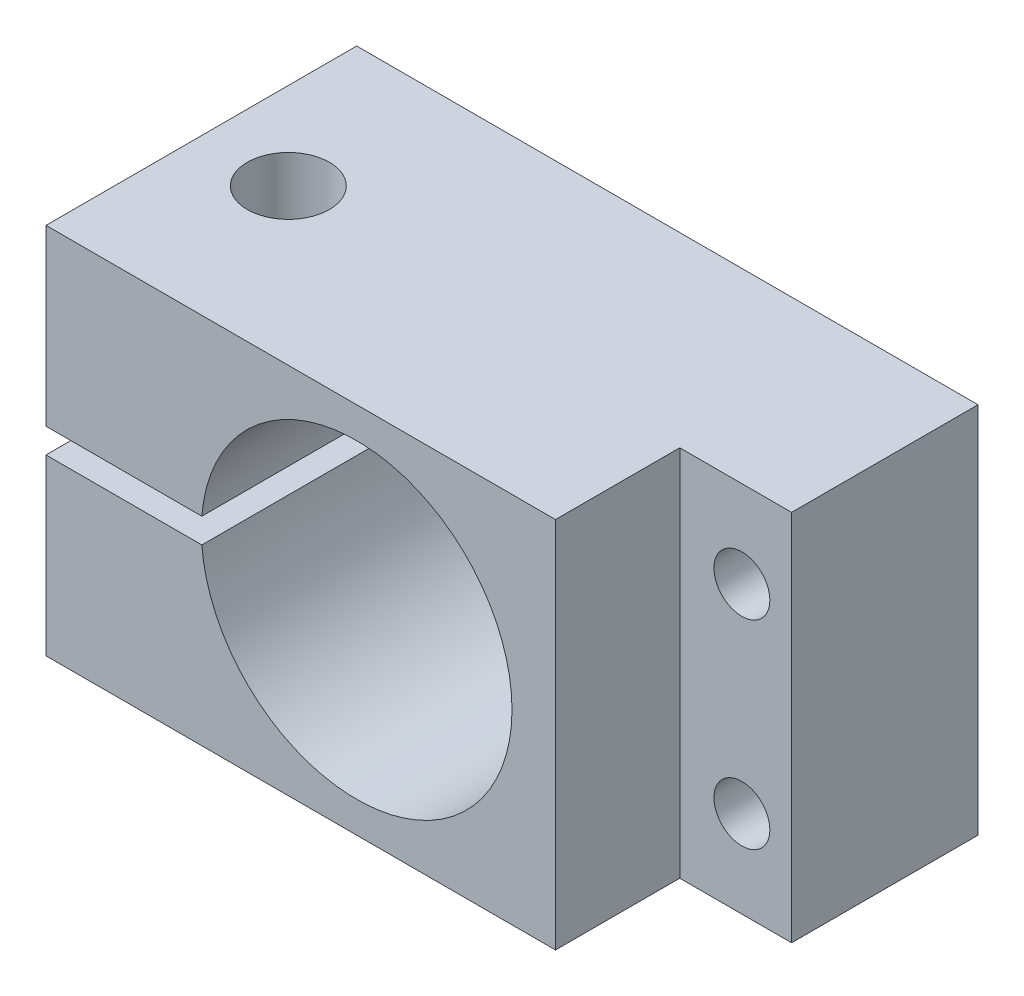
ISO-10303-21;
HEADER;
FILE_DESCRIPTION(('STEP AP214'),'2;1');
FILE_NAME('part.step','',(''),(''),'','','');
FILE_SCHEMA(('AUTOMOTIVE_DESIGN { 1 0 10303 214 1 1 1 1 }'));
ENDSEC;
DATA;
#1=APPLICATION_CONTEXT('core data for automotive mechanical design processes');
#2=APPLICATION_PROTOCOL_DEFINITION('international standard','automotive_design',2000,#1);
#3=PRODUCT_CONTEXT('',#1,'mechanical');
#4=PRODUCT('Part','Part','',(#3));
#5=PRODUCT_RELATED_PRODUCT_CATEGORY('part','',(#4));
#6=PRODUCT_DEFINITION_FORMATION('','',#4);
#7=PRODUCT_DEFINITION_CONTEXT('part definition',#1,'design');
#8=PRODUCT_DEFINITION('design','',#6,#7);
#9=PRODUCT_DEFINITION_SHAPE('','',#8);
#10=(LENGTH_UNIT() NAMED_UNIT(*) SI_UNIT(.MILLI.,.METRE.));
#11=(NAMED_UNIT(*) PLANE_ANGLE_UNIT() SI_UNIT($,.RADIAN.));
#12=(NAMED_UNIT(*) SI_UNIT($,.STERADIAN.) SOLID_ANGLE_UNIT());
#13=UNCERTAINTY_MEASURE_WITH_UNIT(LENGTH_MEASURE(1.E-05),#10,'distance_accuracy_value','');
#14=(GEOMETRIC_REPRESENTATION_CONTEXT(3) GLOBAL_UNCERTAINTY_ASSIGNED_CONTEXT((#13)) GLOBAL_UNIT_ASSIGNED_CONTEXT((#10,
#11,#12)) REPRESENTATION_CONTEXT('',''));
#15=CARTESIAN_POINT('',(0.,0.,0.));
#16=DIRECTION('',(0.,0.,1.));
#17=DIRECTION('',(1.,0.,0.));
#18=AXIS2_PLACEMENT_3D('',#15,#16,#17);
#19=CARTESIAN_POINT('',(25.,15.,12.5));
#20=DIRECTION('',(0.,-1.,0.));
#21=DIRECTION('',(0.,0.,-1.));
#22=AXIS2_PLACEMENT_3D('',#19,#20,#21);
#23=PLANE('',#22);
#24=DIRECTION('',(-1.,0.,0.));
#25=VECTOR('',#24,1.);
#26=CARTESIAN_POINT('',(25.,15.,2.5));
#27=LINE('',#26,#25);
#28=CARTESIAN_POINT('',(25.,15.,2.5));
#29=VERTEX_POINT('',#28);
#30=CARTESIAN_POINT('',(16.,15.,2.5));
#31=VERTEX_POINT('',#30);
#32=EDGE_CURVE('E112',#29,#31,#27,.T.);
#33=ORIENTED_EDGE('',*,*,#32,.F.);
#34=DIRECTION('',(0.,0.,-1.));
#35=VECTOR('',#34,1.);
#36=CARTESIAN_POINT('',(25.,15.,12.5));
#37=LINE('',#36,#35);
#38=CARTESIAN_POINT('',(25.,15.,-12.5));
#39=VERTEX_POINT('',#38);
#40=EDGE_CURVE('E174',#29,#39,#37,.T.);
#41=ORIENTED_EDGE('',*,*,#40,.T.);
#42=DIRECTION('',(-1.,0.,0.));
#43=VECTOR('',#42,1.);
#44=CARTESIAN_POINT('',(25.,15.,-12.5));
#45=LINE('',#44,#43);
#46=CARTESIAN_POINT('',(-25.,15.,-12.5));
#47=VERTEX_POINT('',#46);
#48=EDGE_CURVE('E153',#39,#47,#45,.T.);
#49=ORIENTED_EDGE('',*,*,#48,.T.);
#50=DIRECTION('',(0.,0.,-1.));
#51=VECTOR('',#50,1.);
#52=CARTESIAN_POINT('',(-25.,15.,12.5));
#53=LINE('',#52,#51);
#54=CARTESIAN_POINT('',(-25.,15.,12.5));
#55=VERTEX_POINT('',#54);
#56=EDGE_CURVE('E181',#55,#47,#53,.T.);
#57=ORIENTED_EDGE('',*,*,#56,.F.);
#58=DIRECTION('',(-1.,0.,0.));
#59=VECTOR('',#58,1.);
#60=CARTESIAN_POINT('',(25.,15.,12.5));
#61=LINE('',#60,#59);
#62=CARTESIAN_POINT('',(16.,15.,12.5));
#63=VERTEX_POINT('',#62);
#64=EDGE_CURVE('E131',#63,#55,#61,.T.);
#65=ORIENTED_EDGE('',*,*,#64,.F.);
#66=DIRECTION('',(0.,0.,1.));
#67=VECTOR('',#66,1.);
#68=CARTESIAN_POINT('',(16.,15.,12.5));
#69=LINE('',#68,#67);
#70=EDGE_CURVE('E123',#31,#63,#69,.T.);
#71=ORIENTED_EDGE('',*,*,#70,.F.);
#72=EDGE_LOOP('',(#33,#41,#49,#57,#65,#71));
#73=FACE_BOUND('',#72,.T.);
#74=CARTESIAN_POINT('',(-18.,15.,0.));
#75=DIRECTION('',(0.,1.,0.));
#76=DIRECTION('',(0.,0.,1.));
#77=AXIS2_PLACEMENT_3D('',#74,#75,#76);
#78=CIRCLE('',#77,3.3);
#79=CARTESIAN_POINT('',(-18.,15.,3.3));
#80=VERTEX_POINT('',#79);
#81=EDGE_CURVE('E187',#80,#80,#78,.T.);
#82=ORIENTED_EDGE('',*,*,#81,.F.);
#83=EDGE_LOOP('',(#82));
#84=FACE_BOUND('',#83,.T.);
#85=ADVANCED_FACE('F35',(#73,#84),#23,.F.);
#86=CARTESIAN_POINT('',(-25.,-15.,12.5));
#87=DIRECTION('',(0.,1.,0.));
#88=DIRECTION('',(0.,0.,1.));
#89=AXIS2_PLACEMENT_3D('',#86,#87,#88);
#90=PLANE('',#89);
#91=DIRECTION('',(1.,0.,0.));
#92=VECTOR('',#91,1.);
#93=CARTESIAN_POINT('',(-25.,-15.,2.5));
#94=LINE('',#93,#92);
#95=CARTESIAN_POINT('',(16.,-15.,2.5));
#96=VERTEX_POINT('',#95);
#97=CARTESIAN_POINT('',(25.,-15.,2.5));
#98=VERTEX_POINT('',#97);
#99=EDGE_CURVE('E51',#96,#98,#94,.T.);
#100=ORIENTED_EDGE('',*,*,#99,.F.);
#101=DIRECTION('',(0.,0.,-1.));
#102=VECTOR('',#101,1.);
#103=CARTESIAN_POINT('',(16.,-15.,12.5));
#104=LINE('',#103,#102);
#105=CARTESIAN_POINT('',(16.,-15.,12.5));
#106=VERTEX_POINT('',#105);
#107=EDGE_CURVE('E12',#106,#96,#104,.T.);
#108=ORIENTED_EDGE('',*,*,#107,.F.);
#109=DIRECTION('',(1.,0.,0.));
#110=VECTOR('',#109,1.);
#111=CARTESIAN_POINT('',(-25.,-15.,12.5));
#112=LINE('',#111,#110);
#113=CARTESIAN_POINT('',(-25.,-15.,12.5));
#114=VERTEX_POINT('',#113);
#115=EDGE_CURVE('E171',#114,#106,#112,.T.);
#116=ORIENTED_EDGE('',*,*,#115,.F.);
#117=DIRECTION('',(0.,0.,-1.));
#118=VECTOR('',#117,1.);
#119=CARTESIAN_POINT('',(-25.,-15.,12.5));
#120=LINE('',#119,#118);
#121=CARTESIAN_POINT('',(-25.,-15.,-12.5));
#122=VERTEX_POINT('',#121);
#123=EDGE_CURVE('E178',#114,#122,#120,.T.);
#124=ORIENTED_EDGE('',*,*,#123,.T.);
#125=DIRECTION('',(1.,0.,0.));
#126=VECTOR('',#125,1.);
#127=CARTESIAN_POINT('',(-25.,-15.,-12.5));
#128=LINE('',#127,#126);
#129=CARTESIAN_POINT('',(25.,-15.,-12.5));
#130=VERTEX_POINT('',#129);
#131=EDGE_CURVE('E160',#122,#130,#128,.T.);
#132=ORIENTED_EDGE('',*,*,#131,.T.);
#133=DIRECTION('',(0.,0.,-1.));
#134=VECTOR('',#133,1.);
#135=CARTESIAN_POINT('',(25.,-15.,12.5));
#136=LINE('',#135,#134);
#137=EDGE_CURVE('E176',#98,#130,#136,.T.);
#138=ORIENTED_EDGE('',*,*,#137,.F.);
#139=EDGE_LOOP('',(#100,#108,#116,#124,#132,#138));
#140=FACE_BOUND('',#139,.T.);
#141=CARTESIAN_POINT('',(-18.,-15.,0.));
#142=DIRECTION('',(0.,1.,0.));
#143=DIRECTION('',(0.,0.,1.));
#144=AXIS2_PLACEMENT_3D('',#141,#142,#143);
#145=CIRCLE('',#144,3.);
#146=CARTESIAN_POINT('',(-18.,-15.,3.));
#147=VERTEX_POINT('',#146);
#148=EDGE_CURVE('E199',#147,#147,#145,.T.);
#149=ORIENTED_EDGE('',*,*,#148,.T.);
#150=EDGE_LOOP('',(#149));
#151=FACE_BOUND('',#150,.T.);
#152=ADVANCED_FACE('F234',(#140,#151),#90,.F.);
#153=CARTESIAN_POINT('',(-12.459935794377,1.,12.5));
#154=DIRECTION('',(0.,-1.,0.));
#155=DIRECTION('',(0.,0.,-1.));
#156=AXIS2_PLACEMENT_3D('',#153,#154,#155);
#157=PLANE('',#156);
#158=DIRECTION('',(0.,0.,-1.));
#159=VECTOR('',#158,1.);
#160=CARTESIAN_POINT('',(-25.,1.,12.5));
#161=LINE('',#160,#159);
#162=CARTESIAN_POINT('',(-25.,1.,12.5));
#163=VERTEX_POINT('',#162);
#164=CARTESIAN_POINT('',(-25.,1.,-12.5));
#165=VERTEX_POINT('',#164);
#166=EDGE_CURVE('E151',#163,#165,#161,.T.);
#167=ORIENTED_EDGE('',*,*,#166,.T.);
#168=DIRECTION('',(-1.,0.,0.));
#169=VECTOR('',#168,1.);
#170=CARTESIAN_POINT('',(-12.459935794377,1.,-12.5));
#171=LINE('',#170,#169);
#172=CARTESIAN_POINT('',(-12.459935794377,0.999999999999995,-12.5));
#173=VERTEX_POINT('',#172);
#174=EDGE_CURVE('E59',#173,#165,#171,.T.);
#175=ORIENTED_EDGE('',*,*,#174,.F.);
#176=DIRECTION('',(0.,0.,-1.));
#177=VECTOR('',#176,1.);
#178=CARTESIAN_POINT('',(-12.459935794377,0.999999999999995,12.5));
#179=LINE('',#178,#177);
#180=CARTESIAN_POINT('',(-12.459935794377,0.999999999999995,12.5));
#181=VERTEX_POINT('',#180);
#182=EDGE_CURVE('E145',#181,#173,#179,.T.);
#183=ORIENTED_EDGE('',*,*,#182,.F.);
#184=DIRECTION('',(-1.,0.,0.));
#185=VECTOR('',#184,1.);
#186=CARTESIAN_POINT('',(-12.459935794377,1.,12.5));
#187=LINE('',#186,#185);
#188=EDGE_CURVE('E139',#181,#163,#187,.T.);
#189=ORIENTED_EDGE('',*,*,#188,.T.);
#190=EDGE_LOOP('',(#167,#175,#183,#189));
#191=FACE_BOUND('',#190,.T.);
#192=CARTESIAN_POINT('',(-18.,1.,0.));
#193=DIRECTION('',(0.,-1.,0.));
#194=DIRECTION('',(0.,0.,-1.));
#195=AXIS2_PLACEMENT_3D('',#192,#193,#194);
#196=CIRCLE('',#195,3.3);
#197=CARTESIAN_POINT('',(-18.,1.,-3.3));
#198=VERTEX_POINT('',#197);
#199=EDGE_CURVE('E38',#198,#198,#196,.F.);
#200=ORIENTED_EDGE('',*,*,#199,.T.);
#201=EDGE_LOOP('',(#200));
#202=FACE_BOUND('',#201,.T.);
#203=ADVANCED_FACE('F238',(#191,#202),#157,.T.);
#204=CARTESIAN_POINT('',(-26.,-1.,12.5));
#205=DIRECTION('',(0.,1.,0.));
#206=DIRECTION('',(0.,0.,1.));
#207=AXIS2_PLACEMENT_3D('',#204,#205,#206);
#208=PLANE('',#207);
#209=DIRECTION('',(0.,0.,1.));
#210=VECTOR('',#209,1.);
#211=CARTESIAN_POINT('',(-25.,-1.,12.5));
#212=LINE('',#211,#210);
#213=CARTESIAN_POINT('',(-25.,-1.,-12.5));
#214=VERTEX_POINT('',#213);
#215=CARTESIAN_POINT('',(-25.,-1.,12.5));
#216=VERTEX_POINT('',#215);
#217=EDGE_CURVE('E149',#214,#216,#212,.T.);
#218=ORIENTED_EDGE('',*,*,#217,.T.);
#219=DIRECTION('',(1.,0.,0.));
#220=VECTOR('',#219,1.);
#221=CARTESIAN_POINT('',(-26.,-1.,12.5));
#222=LINE('',#221,#220);
#223=CARTESIAN_POINT('',(-12.459935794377,-1.,12.5));
#224=VERTEX_POINT('',#223);
#225=EDGE_CURVE('E141',#216,#224,#222,.T.);
#226=ORIENTED_EDGE('',*,*,#225,.T.);
#227=DIRECTION('',(0.,0.,-1.));
#228=VECTOR('',#227,1.);
#229=CARTESIAN_POINT('',(-12.459935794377,-1.,12.5));
#230=LINE('',#229,#228);
#231=CARTESIAN_POINT('',(-12.459935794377,-1.,-12.5));
#232=VERTEX_POINT('',#231);
#233=EDGE_CURVE('E147',#224,#232,#230,.T.);
#234=ORIENTED_EDGE('',*,*,#233,.T.);
#235=DIRECTION('',(-1.,0.,0.));
#236=VECTOR('',#235,1.);
#237=CARTESIAN_POINT('',(-25.,-1.,-12.5));
#238=LINE('',#237,#236);
#239=EDGE_CURVE('E183',#232,#214,#238,.T.);
#240=ORIENTED_EDGE('',*,*,#239,.T.);
#241=EDGE_LOOP('',(#218,#226,#234,#240));
#242=FACE_BOUND('',#241,.T.);
#243=CARTESIAN_POINT('',(-18.,-1.,0.));
#244=DIRECTION('',(0.,1.,0.));
#245=DIRECTION('',(0.,0.,1.));
#246=AXIS2_PLACEMENT_3D('',#243,#244,#245);
#247=CIRCLE('',#246,2.4585);
#248=CARTESIAN_POINT('',(-18.,-1.,2.4585));
#249=VERTEX_POINT('',#248);
#250=EDGE_CURVE('E185',#249,#249,#247,.F.);
#251=ORIENTED_EDGE('',*,*,#250,.T.);
#252=EDGE_LOOP('',(#251));
#253=FACE_BOUND('',#252,.T.);
#254=ADVANCED_FACE('F244',(#242,#253),#208,.T.);
#255=CARTESIAN_POINT('',(-25.,15.,12.5));
#256=DIRECTION('',(0.,0.,1.));
#257=DIRECTION('',(1.,0.,0.));
#258=AXIS2_PLACEMENT_3D('',#255,#256,#257);
#259=PLANE('',#258);
#260=ORIENTED_EDGE('',*,*,#115,.T.);
#261=DIRECTION('',(0.,1.,0.));
#262=VECTOR('',#261,1.);
#263=CARTESIAN_POINT('',(16.,15.,12.5));
#264=LINE('',#263,#262);
#265=EDGE_CURVE('E119',#106,#63,#264,.T.);
#266=ORIENTED_EDGE('',*,*,#265,.T.);
#267=ORIENTED_EDGE('',*,*,#64,.T.);
#268=DIRECTION('',(0.,-1.,0.));
#269=VECTOR('',#268,1.);
#270=CARTESIAN_POINT('',(-25.,15.,12.5));
#271=LINE('',#270,#269);
#272=EDGE_CURVE('E168',#55,#163,#271,.T.);
#273=ORIENTED_EDGE('',*,*,#272,.T.);
#274=ORIENTED_EDGE('',*,*,#188,.F.);
#275=CARTESIAN_POINT('',(0.,0.,12.5));
#276=DIRECTION('',(0.,0.,1.));
#277=DIRECTION('',(1.,0.,0.));
#278=AXIS2_PLACEMENT_3D('',#275,#276,#277);
#279=CIRCLE('',#278,12.4999999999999);
#280=EDGE_CURVE('E143',#224,#181,#279,.T.);
#281=ORIENTED_EDGE('',*,*,#280,.F.);
#282=ORIENTED_EDGE('',*,*,#225,.F.);
#283=EDGE_CURVE('E167',#216,#114,#271,.T.);
#284=ORIENTED_EDGE('',*,*,#283,.T.);
#285=EDGE_LOOP('',(#260,#266,#267,#273,#274,#281,#282,#284));
#286=FACE_BOUND('',#285,.T.);
#287=ADVANCED_FACE('F259',(#286),#259,.T.);
#288=CARTESIAN_POINT('',(25.,-15.,12.5));
#289=DIRECTION('',(-1.,0.,0.));
#290=DIRECTION('',(0.,0.,1.));
#291=AXIS2_PLACEMENT_3D('',#288,#289,#290);
#292=PLANE('',#291);
#293=DIRECTION('',(0.,1.,0.));
#294=VECTOR('',#293,1.);
#295=CARTESIAN_POINT('',(25.,-15.,2.5));
#296=LINE('',#295,#294);
#297=EDGE_CURVE('E43',#98,#29,#296,.T.);
#298=ORIENTED_EDGE('',*,*,#297,.F.);
#299=ORIENTED_EDGE('',*,*,#137,.T.);
#300=DIRECTION('',(0.,1.,0.));
#301=VECTOR('',#300,1.);
#302=CARTESIAN_POINT('',(25.,-15.,-12.5));
#303=LINE('',#302,#301);
#304=EDGE_CURVE('E163',#130,#39,#303,.T.);
#305=ORIENTED_EDGE('',*,*,#304,.T.);
#306=ORIENTED_EDGE('',*,*,#40,.F.);
#307=EDGE_LOOP('',(#298,#299,#305,#306));
#308=FACE_BOUND('',#307,.T.);
#309=ADVANCED_FACE('F248',(#308),#292,.F.);
#310=CARTESIAN_POINT('',(-25.,15.,12.5));
#311=DIRECTION('',(1.,0.,0.));
#312=DIRECTION('',(0.,0.,-1.));
#313=AXIS2_PLACEMENT_3D('',#310,#311,#312);
#314=PLANE('',#313);
#315=ORIENTED_EDGE('',*,*,#166,.F.);
#316=ORIENTED_EDGE('',*,*,#272,.F.);
#317=ORIENTED_EDGE('',*,*,#56,.T.);
#318=DIRECTION('',(0.,-1.,0.));
#319=VECTOR('',#318,1.);
#320=CARTESIAN_POINT('',(-25.,15.,-12.5));
#321=LINE('',#320,#319);
#322=EDGE_CURVE('E157',#47,#165,#321,.T.);
#323=ORIENTED_EDGE('',*,*,#322,.T.);
#324=EDGE_LOOP('',(#315,#316,#317,#323));
#325=FACE_BOUND('',#324,.T.);
#326=ADVANCED_FACE('F250',(#325),#314,.F.);
#327=ORIENTED_EDGE('',*,*,#217,.F.);
#328=EDGE_CURVE('E156',#214,#122,#321,.T.);
#329=ORIENTED_EDGE('',*,*,#328,.T.);
#330=ORIENTED_EDGE('',*,*,#123,.F.);
#331=ORIENTED_EDGE('',*,*,#283,.F.);
#332=EDGE_LOOP('',(#327,#329,#330,#331));
#333=FACE_BOUND('',#332,.T.);
#334=ADVANCED_FACE('F252',(#333),#314,.F.);
#335=CARTESIAN_POINT('',(-25.,15.,-12.5));
#336=DIRECTION('',(0.,0.,1.));
#337=DIRECTION('',(1.,0.,0.));
#338=AXIS2_PLACEMENT_3D('',#335,#336,#337);
#339=PLANE('',#338);
#340=CARTESIAN_POINT('',(21.,-8.,-12.5));
#341=DIRECTION('',(0.,0.,1.));
#342=DIRECTION('',(1.,0.,0.));
#343=AXIS2_PLACEMENT_3D('',#340,#341,#342);
#344=CIRCLE('',#343,2.25);
#345=CARTESIAN_POINT('',(23.25,-8.,-12.5));
#346=VERTEX_POINT('',#345);
#347=EDGE_CURVE('E205',#346,#346,#344,.T.);
#348=ORIENTED_EDGE('',*,*,#347,.T.);
#349=EDGE_LOOP('',(#348));
#350=FACE_BOUND('',#349,.T.);
#351=CARTESIAN_POINT('',(21.,8.,-12.5));
#352=DIRECTION('',(0.,0.,1.));
#353=DIRECTION('',(1.,0.,0.));
#354=AXIS2_PLACEMENT_3D('',#351,#352,#353);
#355=CIRCLE('',#354,2.25);
#356=CARTESIAN_POINT('',(23.25,8.,-12.5));
#357=VERTEX_POINT('',#356);
#358=EDGE_CURVE('E126',#357,#357,#355,.T.);
#359=ORIENTED_EDGE('',*,*,#358,.T.);
#360=EDGE_LOOP('',(#359));
#361=FACE_BOUND('',#360,.T.);
#362=ORIENTED_EDGE('',*,*,#174,.T.);
#363=ORIENTED_EDGE('',*,*,#322,.F.);
#364=ORIENTED_EDGE('',*,*,#48,.F.);
#365=ORIENTED_EDGE('',*,*,#304,.F.);
#366=ORIENTED_EDGE('',*,*,#131,.F.);
#367=ORIENTED_EDGE('',*,*,#328,.F.);
#368=ORIENTED_EDGE('',*,*,#239,.F.);
#369=CARTESIAN_POINT('',(0.,0.,-12.5));
#370=DIRECTION('',(0.,0.,1.));
#371=DIRECTION('',(1.,0.,0.));
#372=AXIS2_PLACEMENT_3D('',#369,#370,#371);
#373=CIRCLE('',#372,12.4999999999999);
#374=EDGE_CURVE('E133',#232,#173,#373,.T.);
#375=ORIENTED_EDGE('',*,*,#374,.T.);
#376=EDGE_LOOP('',(#362,#363,#364,#365,#366,#367,#368,#375));
#377=FACE_BOUND('',#376,.T.);
#378=ADVANCED_FACE('F215',(#350,#361,#377),#339,.F.);
#379=CARTESIAN_POINT('',(0.,0.,12.5));
#380=DIRECTION('',(0.,0.,-1.));
#381=DIRECTION('',(-1.,0.,0.));
#382=AXIS2_PLACEMENT_3D('',#379,#380,#381);
#383=CYLINDRICAL_SURFACE('',#382,12.4999999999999);
#384=ORIENTED_EDGE('',*,*,#233,.F.);
#385=ORIENTED_EDGE('',*,*,#280,.T.);
#386=ORIENTED_EDGE('',*,*,#182,.T.);
#387=ORIENTED_EDGE('',*,*,#374,.F.);
#388=EDGE_LOOP('',(#384,#385,#386,#387));
#389=FACE_BOUND('',#388,.T.);
#390=ADVANCED_FACE('F277',(#389),#383,.F.);
#391=CARTESIAN_POINT('',(16.,16.,2.5));
#392=DIRECTION('',(1.,0.,0.));
#393=DIRECTION('',(0.,0.,-1.));
#394=AXIS2_PLACEMENT_3D('',#391,#392,#393);
#395=PLANE('',#394);
#396=ORIENTED_EDGE('',*,*,#70,.T.);
#397=ORIENTED_EDGE('',*,*,#265,.F.);
#398=ORIENTED_EDGE('',*,*,#107,.T.);
#399=DIRECTION('',(0.,-1.,0.));
#400=VECTOR('',#399,1.);
#401=CARTESIAN_POINT('',(16.,16.,2.5));
#402=LINE('',#401,#400);
#403=EDGE_CURVE('E115',#31,#96,#402,.T.);
#404=ORIENTED_EDGE('',*,*,#403,.F.);
#405=EDGE_LOOP('',(#396,#397,#398,#404));
#406=FACE_BOUND('',#405,.T.);
#407=ADVANCED_FACE('F122',(#406),#395,.T.);
#408=CARTESIAN_POINT('',(26.,16.,2.5));
#409=DIRECTION('',(0.,0.,1.));
#410=DIRECTION('',(1.,0.,0.));
#411=AXIS2_PLACEMENT_3D('',#408,#409,#410);
#412=PLANE('',#411);
#413=CARTESIAN_POINT('',(21.,-8.,2.5));
#414=DIRECTION('',(0.,0.,1.));
#415=DIRECTION('',(1.,0.,0.));
#416=AXIS2_PLACEMENT_3D('',#413,#414,#415);
#417=CIRCLE('',#416,2.25);
#418=CARTESIAN_POINT('',(23.25,-8.,2.5));
#419=VERTEX_POINT('',#418);
#420=EDGE_CURVE('E191',#419,#419,#417,.T.);
#421=ORIENTED_EDGE('',*,*,#420,.F.);
#422=EDGE_LOOP('',(#421));
#423=FACE_BOUND('',#422,.T.);
#424=CARTESIAN_POINT('',(21.,8.,2.5));
#425=DIRECTION('',(0.,0.,1.));
#426=DIRECTION('',(1.,0.,0.));
#427=AXIS2_PLACEMENT_3D('',#424,#425,#426);
#428=CIRCLE('',#427,2.25);
#429=CARTESIAN_POINT('',(23.25,8.,2.5));
#430=VERTEX_POINT('',#429);
#431=EDGE_CURVE('E208',#430,#430,#428,.T.);
#432=ORIENTED_EDGE('',*,*,#431,.F.);
#433=EDGE_LOOP('',(#432));
#434=FACE_BOUND('',#433,.T.);
#435=ORIENTED_EDGE('',*,*,#32,.T.);
#436=ORIENTED_EDGE('',*,*,#403,.T.);
#437=ORIENTED_EDGE('',*,*,#99,.T.);
#438=ORIENTED_EDGE('',*,*,#297,.T.);
#439=EDGE_LOOP('',(#435,#436,#437,#438));
#440=FACE_BOUND('',#439,.T.);
#441=ADVANCED_FACE('F114',(#423,#434,#440),#412,.T.);
#442=CARTESIAN_POINT('',(21.,8.,-13.5));
#443=DIRECTION('',(0.,0.,1.));
#444=DIRECTION('',(1.,0.,0.));
#445=AXIS2_PLACEMENT_3D('',#442,#443,#444);
#446=CYLINDRICAL_SURFACE('',#445,2.25);
#447=ORIENTED_EDGE('',*,*,#431,.T.);
#448=EDGE_LOOP('',(#447));
#449=FACE_BOUND('',#448,.T.);
#450=ORIENTED_EDGE('',*,*,#358,.F.);
#451=EDGE_LOOP('',(#450));
#452=FACE_BOUND('',#451,.T.);
#453=ADVANCED_FACE('F218',(#449,#452),#446,.F.);
#454=CARTESIAN_POINT('',(21.,-8.,-13.5));
#455=DIRECTION('',(0.,0.,1.));
#456=DIRECTION('',(1.,0.,0.));
#457=AXIS2_PLACEMENT_3D('',#454,#455,#456);
#458=CYLINDRICAL_SURFACE('',#457,2.25);
#459=ORIENTED_EDGE('',*,*,#420,.T.);
#460=EDGE_LOOP('',(#459));
#461=FACE_BOUND('',#460,.T.);
#462=ORIENTED_EDGE('',*,*,#347,.F.);
#463=EDGE_LOOP('',(#462));
#464=FACE_BOUND('',#463,.T.);
#465=ADVANCED_FACE('F220',(#461,#464),#458,.F.);
#466=CARTESIAN_POINT('',(-18.,-15.,0.));
#467=DIRECTION('',(0.,1.,0.));
#468=DIRECTION('',(0.,0.,1.));
#469=AXIS2_PLACEMENT_3D('',#466,#467,#468);
#470=CYLINDRICAL_SURFACE('',#469,2.4585);
#471=ORIENTED_EDGE('',*,*,#250,.F.);
#472=EDGE_LOOP('',(#471));
#473=FACE_BOUND('',#472,.T.);
#474=CARTESIAN_POINT('',(-18.,-14.4585,0.));
#475=DIRECTION('',(0.,1.,0.));
#476=DIRECTION('',(0.,0.,1.));
#477=AXIS2_PLACEMENT_3D('',#474,#475,#476);
#478=CIRCLE('',#477,2.4585);
#479=CARTESIAN_POINT('',(-18.,-14.4585,2.4585));
#480=VERTEX_POINT('',#479);
#481=EDGE_CURVE('E193',#480,#480,#478,.T.);
#482=ORIENTED_EDGE('',*,*,#481,.F.);
#483=EDGE_LOOP('',(#482));
#484=FACE_BOUND('',#483,.T.);
#485=ADVANCED_FACE('F227',(#473,#484),#470,.F.);
#486=CARTESIAN_POINT('',(-18.,-15.,0.));
#487=DIRECTION('',(0.,-1.,0.));
#488=DIRECTION('',(0.,0.,-1.));
#489=AXIS2_PLACEMENT_3D('',#486,#487,#488);
#490=CONICAL_SURFACE('',#489,3.,0.78539816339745);
#491=ORIENTED_EDGE('',*,*,#481,.T.);
#492=EDGE_LOOP('',(#491));
#493=FACE_BOUND('',#492,.T.);
#494=ORIENTED_EDGE('',*,*,#148,.F.);
#495=EDGE_LOOP('',(#494));
#496=FACE_BOUND('',#495,.T.);
#497=ADVANCED_FACE('F283',(#493,#496),#490,.F.);
#498=CARTESIAN_POINT('',(-18.,-15.,0.));
#499=DIRECTION('',(0.,1.,0.));
#500=DIRECTION('',(0.,0.,1.));
#501=AXIS2_PLACEMENT_3D('',#498,#499,#500);
#502=CYLINDRICAL_SURFACE('',#501,3.3);
#503=ORIENTED_EDGE('',*,*,#199,.F.);
#504=EDGE_LOOP('',(#503));
#505=FACE_BOUND('',#504,.T.);
#506=ORIENTED_EDGE('',*,*,#81,.T.);
#507=EDGE_LOOP('',(#506));
#508=FACE_BOUND('',#507,.T.);
#509=ADVANCED_FACE('F281',(#505,#508),#502,.F.);
#510=CLOSED_SHELL('',(#85,#152,#203,#254,#287,#309,#326,#334,#378,#390,#407,#441,#453,#465,#485,
#497,#509));
#511=MANIFOLD_SOLID_BREP('B2',#510);
#512=ADVANCED_BREP_SHAPE_REPRESENTATION('',(#18,#511),#14);
#513=SHAPE_DEFINITION_REPRESENTATION(#9,#512);
ENDSEC;
END-ISO-10303-21;
